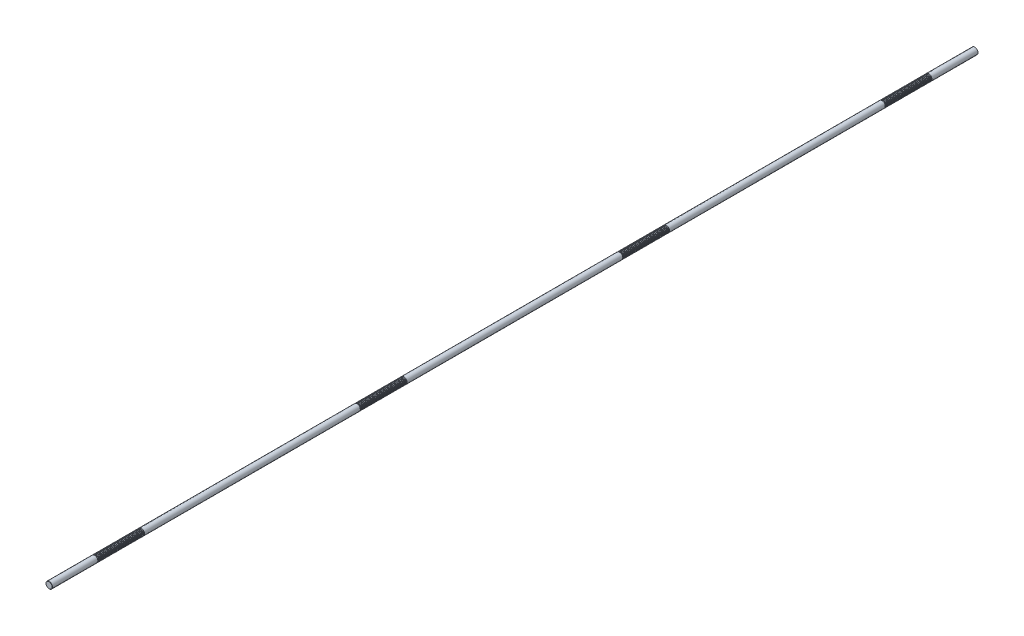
from build123d import *

# Parameters (mm, degrees)
SKETCH1_R           = 7
BOSS_EXTRUDE1_DEPTH = 1000
CHAMFER1_SIZE       = 0.35
LPATTERN1_COUNT     = 34
LPATTERN1_PITCH     = 3
LPATTERN2_COUNT     = 4
LPATTERN2_PITCH     = 567


with BuildPart() as part:
    # Sketch1 → Boss-Extrude1 (new, symmetric)
    with BuildSketch(Plane.XY):
        Circle(SKETCH1_R)
    extrude(amount=BOSS_EXTRUDE1_DEPTH, both=True)

    # Chamfer1
    chamfer1_edges = [part.edges().sort_by_distance(p)[0] for p in [
        (-7, 0, -1000),
        (-7, 0, 1000),
    ]]
    chamfer(chamfer1_edges, length=CHAMFER1_SIZE)

    # Sketch2 → Cut-Revolve1 (revolve, cut)
    with BuildSketch(Plane(origin=(0, 0, 0), x_dir=(0, 0, -1), z_dir=(1, 0, 0)), mode=Mode.PRIVATE) as cut_revolve1_sk:
        Polygon((900.234455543, 7), (898.265544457, 7), (898.734455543, 5.25), (899.765544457, 5.25), align=None)
    cut_revolve1 = revolve(cut_revolve1_sk.sketch.rotate(Axis((0, 0, 1000), (0, 0, -1)), 90), axis=Axis((0, 0, 1000), (0, 0, -1)), mode=Mode.SUBTRACT)

    # LPattern1: Cut-Revolve1 ×34
    with Locations(*[(0, 0, i * LPATTERN1_PITCH) for i in range(1, LPATTERN1_COUNT)]):
        add(cut_revolve1, mode=Mode.SUBTRACT)

    # LPattern2: Cut-Revolve1 ×4
    with Locations(*[(0, 0, i * LPATTERN2_PITCH) for i in range(1, LPATTERN2_COUNT)]):
        add(cut_revolve1, mode=Mode.SUBTRACT)

    # LPattern2 copy 1 sketch → LPattern2 copy 1 (revolve, cut)
    with BuildSketch(Plane(origin=(0, 0, 570), x_dir=(0, 0, -1), z_dir=(1, 0, 0))):
        Polygon((900.234455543, 7), (898.265544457, 7), (898.734455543, 5.25), (899.765544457, 5.25), align=None)
    revolve(axis=Axis((0, 0, 1570), (0, 0, -1)), mode=Mode.SUBTRACT)

    # LPattern2 copy 2 sketch → LPattern2 copy 2 (revolve, cut)
    with BuildSketch(Plane(origin=(0, 0, 1137), x_dir=(0, 0, -1), z_dir=(1, 0, 0))):
        Polygon((900.234455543, 7), (898.265544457, 7), (898.734455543, 5.25), (899.765544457, 5.25), align=None)
    revolve(axis=Axis((0, 0, 2137), (0, 0, -1)), mode=Mode.SUBTRACT)

    # LPattern2 copy 3 sketch → LPattern2 copy 3 (revolve, cut)
    with BuildSketch(Plane(origin=(0, 0, 1704), x_dir=(0, 0, -1), z_dir=(1, 0, 0))):
        Polygon((900.234455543, 7), (898.265544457, 7), (898.734455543, 5.25), (899.765544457, 5.25), align=None)
    revolve(axis=Axis((0, 0, 2704), (0, 0, -1)), mode=Mode.SUBTRACT)

    # LPattern2 copy 4 sketch → LPattern2 copy 4 (revolve, cut)
    with BuildSketch(Plane(origin=(0, 0, 573), x_dir=(0, 0, -1), z_dir=(1, 0, 0))):
        Polygon((900.234455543, 7), (898.265544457, 7), (898.734455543, 5.25), (899.765544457, 5.25), align=None)
    revolve(axis=Axis((0, 0, 1573), (0, 0, -1)), mode=Mode.SUBTRACT)

    # LPattern2 copy 5 sketch → LPattern2 copy 5 (revolve, cut)
    with BuildSketch(Plane(origin=(0, 0, 1140), x_dir=(0, 0, -1), z_dir=(1, 0, 0))):
        Polygon((900.234455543, 7), (898.265544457, 7), (898.734455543, 5.25), (899.765544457, 5.25), align=None)
    revolve(axis=Axis((0, 0, 2140), (0, 0, -1)), mode=Mode.SUBTRACT)

    # LPattern2 copy 6 sketch → LPattern2 copy 6 (revolve, cut)
    with BuildSketch(Plane(origin=(0, 0, 1707), x_dir=(0, 0, -1), z_dir=(1, 0, 0))):
        Polygon((900.234455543, 7), (898.265544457, 7), (898.734455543, 5.25), (899.765544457, 5.25), align=None)
    revolve(axis=Axis((0, 0, 2707), (0, 0, -1)), mode=Mode.SUBTRACT)

    # LPattern2 copy 7 sketch → LPattern2 copy 7 (revolve, cut)
    with BuildSketch(Plane(origin=(0, 0, 576), x_dir=(0, 0, -1), z_dir=(1, 0, 0))):
        Polygon((900.234455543, 7), (898.265544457, 7), (898.734455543, 5.25), (899.765544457, 5.25), align=None)
    revolve(axis=Axis((0, 0, 1576), (0, 0, -1)), mode=Mode.SUBTRACT)

    # LPattern2 copy 8 sketch → LPattern2 copy 8 (revolve, cut)
    with BuildSketch(Plane(origin=(0, 0, 1143), x_dir=(0, 0, -1), z_dir=(1, 0, 0))):
        Polygon((900.234455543, 7), (898.265544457, 7), (898.734455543, 5.25), (899.765544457, 5.25), align=None)
    revolve(axis=Axis((0, 0, 2143), (0, 0, -1)), mode=Mode.SUBTRACT)

    # LPattern2 copy 9 sketch → LPattern2 copy 9 (revolve, cut)
    with BuildSketch(Plane(origin=(0, 0, 1710), x_dir=(0, 0, -1), z_dir=(1, 0, 0))):
        Polygon((900.234455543, 7), (898.265544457, 7), (898.734455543, 5.25), (899.765544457, 5.25), align=None)
    revolve(axis=Axis((0, 0, 2710), (0, 0, -1)), mode=Mode.SUBTRACT)

    # LPattern2 copy 10 sketch → LPattern2 copy 10 (revolve, cut)
    with BuildSketch(Plane(origin=(0, 0, 579), x_dir=(0, 0, -1), z_dir=(1, 0, 0))):
        Polygon((900.234455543, 7), (898.265544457, 7), (898.734455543, 5.25), (899.765544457, 5.25), align=None)
    revolve(axis=Axis((0, 0, 1579), (0, 0, -1)), mode=Mode.SUBTRACT)

    # LPattern2 copy 11 sketch → LPattern2 copy 11 (revolve, cut)
    with BuildSketch(Plane(origin=(0, 0, 1146), x_dir=(0, 0, -1), z_dir=(1, 0, 0))):
        Polygon((900.234455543, 7), (898.265544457, 7), (898.734455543, 5.25), (899.765544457, 5.25), align=None)
    revolve(axis=Axis((0, 0, 2146), (0, 0, -1)), mode=Mode.SUBTRACT)

    # LPattern2 copy 12 sketch → LPattern2 copy 12 (revolve, cut)
    with BuildSketch(Plane(origin=(0, 0, 1713), x_dir=(0, 0, -1), z_dir=(1, 0, 0))):
        Polygon((900.234455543, 7), (898.265544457, 7), (898.734455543, 5.25), (899.765544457, 5.25), align=None)
    revolve(axis=Axis((0, 0, 2713), (0, 0, -1)), mode=Mode.SUBTRACT)

    # LPattern2 copy 13 sketch → LPattern2 copy 13 (revolve, cut)
    with BuildSketch(Plane(origin=(0, 0, 582), x_dir=(0, 0, -1), z_dir=(1, 0, 0))):
        Polygon((900.234455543, 7), (898.265544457, 7), (898.734455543, 5.25), (899.765544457, 5.25), align=None)
    revolve(axis=Axis((0, 0, 1582), (0, 0, -1)), mode=Mode.SUBTRACT)

    # LPattern2 copy 14 sketch → LPattern2 copy 14 (revolve, cut)
    with BuildSketch(Plane(origin=(0, 0, 1149), x_dir=(0, 0, -1), z_dir=(1, 0, 0))):
        Polygon((900.234455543, 7), (898.265544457, 7), (898.734455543, 5.25), (899.765544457, 5.25), align=None)
    revolve(axis=Axis((0, 0, 2149), (0, 0, -1)), mode=Mode.SUBTRACT)

    # LPattern2 copy 15 sketch → LPattern2 copy 15 (revolve, cut)
    with BuildSketch(Plane(origin=(0, 0, 1716), x_dir=(0, 0, -1), z_dir=(1, 0, 0))):
        Polygon((900.234455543, 7), (898.265544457, 7), (898.734455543, 5.25), (899.765544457, 5.25), align=None)
    revolve(axis=Axis((0, 0, 2716), (0, 0, -1)), mode=Mode.SUBTRACT)

    # LPattern2 copy 16 sketch → LPattern2 copy 16 (revolve, cut)
    with BuildSketch(Plane(origin=(0, 0, 585), x_dir=(0, 0, -1), z_dir=(1, 0, 0))):
        Polygon((900.234455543, 7), (898.265544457, 7), (898.734455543, 5.25), (899.765544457, 5.25), align=None)
    revolve(axis=Axis((0, 0, 1585), (0, 0, -1)), mode=Mode.SUBTRACT)

    # LPattern2 copy 17 sketch → LPattern2 copy 17 (revolve, cut)
    with BuildSketch(Plane(origin=(0, 0, 1152), x_dir=(0, 0, -1), z_dir=(1, 0, 0))):
        Polygon((900.234455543, 7), (898.265544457, 7), (898.734455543, 5.25), (899.765544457, 5.25), align=None)
    revolve(axis=Axis((0, 0, 2152), (0, 0, -1)), mode=Mode.SUBTRACT)

    # LPattern2 copy 18 sketch → LPattern2 copy 18 (revolve, cut)
    with BuildSketch(Plane(origin=(0, 0, 1719), x_dir=(0, 0, -1), z_dir=(1, 0, 0))):
        Polygon((900.234455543, 7), (898.265544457, 7), (898.734455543, 5.25), (899.765544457, 5.25), align=None)
    revolve(axis=Axis((0, 0, 2719), (0, 0, -1)), mode=Mode.SUBTRACT)

    # LPattern2 copy 19 sketch → LPattern2 copy 19 (revolve, cut)
    with BuildSketch(Plane(origin=(0, 0, 588), x_dir=(0, 0, -1), z_dir=(1, 0, 0))):
        Polygon((900.234455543, 7), (898.265544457, 7), (898.734455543, 5.25), (899.765544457, 5.25), align=None)
    revolve(axis=Axis((0, 0, 1588), (0, 0, -1)), mode=Mode.SUBTRACT)

    # LPattern2 copy 20 sketch → LPattern2 copy 20 (revolve, cut)
    with BuildSketch(Plane(origin=(0, 0, 1155), x_dir=(0, 0, -1), z_dir=(1, 0, 0))):
        Polygon((900.234455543, 7), (898.265544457, 7), (898.734455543, 5.25), (899.765544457, 5.25), align=None)
    revolve(axis=Axis((0, 0, 2155), (0, 0, -1)), mode=Mode.SUBTRACT)

    # LPattern2 copy 21 sketch → LPattern2 copy 21 (revolve, cut)
    with BuildSketch(Plane(origin=(0, 0, 1722), x_dir=(0, 0, -1), z_dir=(1, 0, 0))):
        Polygon((900.234455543, 7), (898.265544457, 7), (898.734455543, 5.25), (899.765544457, 5.25), align=None)
    revolve(axis=Axis((0, 0, 2722), (0, 0, -1)), mode=Mode.SUBTRACT)

    # LPattern2 copy 22 sketch → LPattern2 copy 22 (revolve, cut)
    with BuildSketch(Plane(origin=(0, 0, 591), x_dir=(0, 0, -1), z_dir=(1, 0, 0))):
        Polygon((900.234455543, 7), (898.265544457, 7), (898.734455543, 5.25), (899.765544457, 5.25), align=None)
    revolve(axis=Axis((0, 0, 1591), (0, 0, -1)), mode=Mode.SUBTRACT)

    # LPattern2 copy 23 sketch → LPattern2 copy 23 (revolve, cut)
    with BuildSketch(Plane(origin=(0, 0, 1158), x_dir=(0, 0, -1), z_dir=(1, 0, 0))):
        Polygon((900.234455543, 7), (898.265544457, 7), (898.734455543, 5.25), (899.765544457, 5.25), align=None)
    revolve(axis=Axis((0, 0, 2158), (0, 0, -1)), mode=Mode.SUBTRACT)

    # LPattern2 copy 24 sketch → LPattern2 copy 24 (revolve, cut)
    with BuildSketch(Plane(origin=(0, 0, 1725), x_dir=(0, 0, -1), z_dir=(1, 0, 0))):
        Polygon((900.234455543, 7), (898.265544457, 7), (898.734455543, 5.25), (899.765544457, 5.25), align=None)
    revolve(axis=Axis((0, 0, 2725), (0, 0, -1)), mode=Mode.SUBTRACT)

    # LPattern2 copy 25 sketch → LPattern2 copy 25 (revolve, cut)
    with BuildSketch(Plane(origin=(0, 0, 594), x_dir=(0, 0, -1), z_dir=(1, 0, 0))):
        Polygon((900.234455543, 7), (898.265544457, 7), (898.734455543, 5.25), (899.765544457, 5.25), align=None)
    revolve(axis=Axis((0, 0, 1594), (0, 0, -1)), mode=Mode.SUBTRACT)

    # LPattern2 copy 26 sketch → LPattern2 copy 26 (revolve, cut)
    with BuildSketch(Plane(origin=(0, 0, 1161), x_dir=(0, 0, -1), z_dir=(1, 0, 0))):
        Polygon((900.234455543, 7), (898.265544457, 7), (898.734455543, 5.25), (899.765544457, 5.25), align=None)
    revolve(axis=Axis((0, 0, 2161), (0, 0, -1)), mode=Mode.SUBTRACT)

    # LPattern2 copy 27 sketch → LPattern2 copy 27 (revolve, cut)
    with BuildSketch(Plane(origin=(0, 0, 1728), x_dir=(0, 0, -1), z_dir=(1, 0, 0))):
        Polygon((900.234455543, 7), (898.265544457, 7), (898.734455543, 5.25), (899.765544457, 5.25), align=None)
    revolve(axis=Axis((0, 0, 2728), (0, 0, -1)), mode=Mode.SUBTRACT)

    # LPattern2 copy 28 sketch → LPattern2 copy 28 (revolve, cut)
    with BuildSketch(Plane(origin=(0, 0, 597), x_dir=(0, 0, -1), z_dir=(1, 0, 0))):
        Polygon((900.234455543, 7), (898.265544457, 7), (898.734455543, 5.25), (899.765544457, 5.25), align=None)
    revolve(axis=Axis((0, 0, 1597), (0, 0, -1)), mode=Mode.SUBTRACT)

    # LPattern2 copy 29 sketch → LPattern2 copy 29 (revolve, cut)
    with BuildSketch(Plane(origin=(0, 0, 1164), x_dir=(0, 0, -1), z_dir=(1, 0, 0))):
        Polygon((900.234455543, 7), (898.265544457, 7), (898.734455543, 5.25), (899.765544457, 5.25), align=None)
    revolve(axis=Axis((0, 0, 2164), (0, 0, -1)), mode=Mode.SUBTRACT)

    # LPattern2 copy 30 sketch → LPattern2 copy 30 (revolve, cut)
    with BuildSketch(Plane(origin=(0, 0, 1731), x_dir=(0, 0, -1), z_dir=(1, 0, 0))):
        Polygon((900.234455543, 7), (898.265544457, 7), (898.734455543, 5.25), (899.765544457, 5.25), align=None)
    revolve(axis=Axis((0, 0, 2731), (0, 0, -1)), mode=Mode.SUBTRACT)

    # LPattern2 copy 31 sketch → LPattern2 copy 31 (revolve, cut)
    with BuildSketch(Plane(origin=(0, 0, 600), x_dir=(0, 0, -1), z_dir=(1, 0, 0))):
        Polygon((900.234455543, 7), (898.265544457, 7), (898.734455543, 5.25), (899.765544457, 5.25), align=None)
    revolve(axis=Axis((0, 0, 1600), (0, 0, -1)), mode=Mode.SUBTRACT)

    # LPattern2 copy 32 sketch → LPattern2 copy 32 (revolve, cut)
    with BuildSketch(Plane(origin=(0, 0, 1167), x_dir=(0, 0, -1), z_dir=(1, 0, 0))):
        Polygon((900.234455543, 7), (898.265544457, 7), (898.734455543, 5.25), (899.765544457, 5.25), align=None)
    revolve(axis=Axis((0, 0, 2167), (0, 0, -1)), mode=Mode.SUBTRACT)

    # LPattern2 copy 33 sketch → LPattern2 copy 33 (revolve, cut)
    with BuildSketch(Plane(origin=(0, 0, 1734), x_dir=(0, 0, -1), z_dir=(1, 0, 0))):
        Polygon((900.234455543, 7), (898.265544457, 7), (898.734455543, 5.25), (899.765544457, 5.25), align=None)
    revolve(axis=Axis((0, 0, 2734), (0, 0, -1)), mode=Mode.SUBTRACT)

    # LPattern2 copy 34 sketch → LPattern2 copy 34 (revolve, cut)
    with BuildSketch(Plane(origin=(0, 0, 603), x_dir=(0, 0, -1), z_dir=(1, 0, 0))):
        Polygon((900.234455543, 7), (898.265544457, 7), (898.734455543, 5.25), (899.765544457, 5.25), align=None)
    revolve(axis=Axis((0, 0, 1603), (0, 0, -1)), mode=Mode.SUBTRACT)

    # LPattern2 copy 35 sketch → LPattern2 copy 35 (revolve, cut)
    with BuildSketch(Plane(origin=(0, 0, 1170), x_dir=(0, 0, -1), z_dir=(1, 0, 0))):
        Polygon((900.234455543, 7), (898.265544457, 7), (898.734455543, 5.25), (899.765544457, 5.25), align=None)
    revolve(axis=Axis((0, 0, 2170), (0, 0, -1)), mode=Mode.SUBTRACT)

    # LPattern2 copy 36 sketch → LPattern2 copy 36 (revolve, cut)
    with BuildSketch(Plane(origin=(0, 0, 1737), x_dir=(0, 0, -1), z_dir=(1, 0, 0))):
        Polygon((900.234455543, 7), (898.265544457, 7), (898.734455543, 5.25), (899.765544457, 5.25), align=None)
    revolve(axis=Axis((0, 0, 2737), (0, 0, -1)), mode=Mode.SUBTRACT)

    # LPattern2 copy 37 sketch → LPattern2 copy 37 (revolve, cut)
    with BuildSketch(Plane(origin=(0, 0, 606), x_dir=(0, 0, -1), z_dir=(1, 0, 0))):
        Polygon((900.234455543, 7), (898.265544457, 7), (898.734455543, 5.25), (899.765544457, 5.25), align=None)
    revolve(axis=Axis((0, 0, 1606), (0, 0, -1)), mode=Mode.SUBTRACT)

    # LPattern2 copy 38 sketch → LPattern2 copy 38 (revolve, cut)
    with BuildSketch(Plane(origin=(0, 0, 1173), x_dir=(0, 0, -1), z_dir=(1, 0, 0))):
        Polygon((900.234455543, 7), (898.265544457, 7), (898.734455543, 5.25), (899.765544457, 5.25), align=None)
    revolve(axis=Axis((0, 0, 2173), (0, 0, -1)), mode=Mode.SUBTRACT)

    # LPattern2 copy 39 sketch → LPattern2 copy 39 (revolve, cut)
    with BuildSketch(Plane(origin=(0, 0, 1740), x_dir=(0, 0, -1), z_dir=(1, 0, 0))):
        Polygon((900.234455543, 7), (898.265544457, 7), (898.734455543, 5.25), (899.765544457, 5.25), align=None)
    revolve(axis=Axis((0, 0, 2740), (0, 0, -1)), mode=Mode.SUBTRACT)

    # LPattern2 copy 40 sketch → LPattern2 copy 40 (revolve, cut)
    with BuildSketch(Plane(origin=(0, 0, 609), x_dir=(0, 0, -1), z_dir=(1, 0, 0))):
        Polygon((900.234455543, 7), (898.265544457, 7), (898.734455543, 5.25), (899.765544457, 5.25), align=None)
    revolve(axis=Axis((0, 0, 1609), (0, 0, -1)), mode=Mode.SUBTRACT)

    # LPattern2 copy 41 sketch → LPattern2 copy 41 (revolve, cut)
    with BuildSketch(Plane(origin=(0, 0, 1176), x_dir=(0, 0, -1), z_dir=(1, 0, 0))):
        Polygon((900.234455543, 7), (898.265544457, 7), (898.734455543, 5.25), (899.765544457, 5.25), align=None)
    revolve(axis=Axis((0, 0, 2176), (0, 0, -1)), mode=Mode.SUBTRACT)

    # LPattern2 copy 42 sketch → LPattern2 copy 42 (revolve, cut)
    with BuildSketch(Plane(origin=(0, 0, 1743), x_dir=(0, 0, -1), z_dir=(1, 0, 0))):
        Polygon((900.234455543, 7), (898.265544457, 7), (898.734455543, 5.25), (899.765544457, 5.25), align=None)
    revolve(axis=Axis((0, 0, 2743), (0, 0, -1)), mode=Mode.SUBTRACT)

    # LPattern2 copy 43 sketch → LPattern2 copy 43 (revolve, cut)
    with BuildSketch(Plane(origin=(0, 0, 612), x_dir=(0, 0, -1), z_dir=(1, 0, 0))):
        Polygon((900.234455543, 7), (898.265544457, 7), (898.734455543, 5.25), (899.765544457, 5.25), align=None)
    revolve(axis=Axis((0, 0, 1612), (0, 0, -1)), mode=Mode.SUBTRACT)

    # LPattern2 copy 44 sketch → LPattern2 copy 44 (revolve, cut)
    with BuildSketch(Plane(origin=(0, 0, 1179), x_dir=(0, 0, -1), z_dir=(1, 0, 0))):
        Polygon((900.234455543, 7), (898.265544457, 7), (898.734455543, 5.25), (899.765544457, 5.25), align=None)
    revolve(axis=Axis((0, 0, 2179), (0, 0, -1)), mode=Mode.SUBTRACT)

    # LPattern2 copy 45 sketch → LPattern2 copy 45 (revolve, cut)
    with BuildSketch(Plane(origin=(0, 0, 1746), x_dir=(0, 0, -1), z_dir=(1, 0, 0))):
        Polygon((900.234455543, 7), (898.265544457, 7), (898.734455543, 5.25), (899.765544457, 5.25), align=None)
    revolve(axis=Axis((0, 0, 2746), (0, 0, -1)), mode=Mode.SUBTRACT)

    # LPattern2 copy 46 sketch → LPattern2 copy 46 (revolve, cut)
    with BuildSketch(Plane(origin=(0, 0, 615), x_dir=(0, 0, -1), z_dir=(1, 0, 0))):
        Polygon((900.234455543, 7), (898.265544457, 7), (898.734455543, 5.25), (899.765544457, 5.25), align=None)
    revolve(axis=Axis((0, 0, 1615), (0, 0, -1)), mode=Mode.SUBTRACT)

    # LPattern2 copy 47 sketch → LPattern2 copy 47 (revolve, cut)
    with BuildSketch(Plane(origin=(0, 0, 1182), x_dir=(0, 0, -1), z_dir=(1, 0, 0))):
        Polygon((900.234455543, 7), (898.265544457, 7), (898.734455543, 5.25), (899.765544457, 5.25), align=None)
    revolve(axis=Axis((0, 0, 2182), (0, 0, -1)), mode=Mode.SUBTRACT)

    # LPattern2 copy 48 sketch → LPattern2 copy 48 (revolve, cut)
    with BuildSketch(Plane(origin=(0, 0, 1749), x_dir=(0, 0, -1), z_dir=(1, 0, 0))):
        Polygon((900.234455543, 7), (898.265544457, 7), (898.734455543, 5.25), (899.765544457, 5.25), align=None)
    revolve(axis=Axis((0, 0, 2749), (0, 0, -1)), mode=Mode.SUBTRACT)

    # LPattern2 copy 49 sketch → LPattern2 copy 49 (revolve, cut)
    with BuildSketch(Plane(origin=(0, 0, 618), x_dir=(0, 0, -1), z_dir=(1, 0, 0))):
        Polygon((900.234455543, 7), (898.265544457, 7), (898.734455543, 5.25), (899.765544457, 5.25), align=None)
    revolve(axis=Axis((0, 0, 1618), (0, 0, -1)), mode=Mode.SUBTRACT)

    # LPattern2 copy 50 sketch → LPattern2 copy 50 (revolve, cut)
    with BuildSketch(Plane(origin=(0, 0, 1185), x_dir=(0, 0, -1), z_dir=(1, 0, 0))):
        Polygon((900.234455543, 7), (898.265544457, 7), (898.734455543, 5.25), (899.765544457, 5.25), align=None)
    revolve(axis=Axis((0, 0, 2185), (0, 0, -1)), mode=Mode.SUBTRACT)

    # LPattern2 copy 51 sketch → LPattern2 copy 51 (revolve, cut)
    with BuildSketch(Plane(origin=(0, 0, 1752), x_dir=(0, 0, -1), z_dir=(1, 0, 0))):
        Polygon((900.234455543, 7), (898.265544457, 7), (898.734455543, 5.25), (899.765544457, 5.25), align=None)
    revolve(axis=Axis((0, 0, 2752), (0, 0, -1)), mode=Mode.SUBTRACT)

    # LPattern2 copy 52 sketch → LPattern2 copy 52 (revolve, cut)
    with BuildSketch(Plane(origin=(0, 0, 621), x_dir=(0, 0, -1), z_dir=(1, 0, 0))):
        Polygon((900.234455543, 7), (898.265544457, 7), (898.734455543, 5.25), (899.765544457, 5.25), align=None)
    revolve(axis=Axis((0, 0, 1621), (0, 0, -1)), mode=Mode.SUBTRACT)

    # LPattern2 copy 53 sketch → LPattern2 copy 53 (revolve, cut)
    with BuildSketch(Plane(origin=(0, 0, 1188), x_dir=(0, 0, -1), z_dir=(1, 0, 0))):
        Polygon((900.234455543, 7), (898.265544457, 7), (898.734455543, 5.25), (899.765544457, 5.25), align=None)
    revolve(axis=Axis((0, 0, 2188), (0, 0, -1)), mode=Mode.SUBTRACT)

    # LPattern2 copy 54 sketch → LPattern2 copy 54 (revolve, cut)
    with BuildSketch(Plane(origin=(0, 0, 1755), x_dir=(0, 0, -1), z_dir=(1, 0, 0))):
        Polygon((900.234455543, 7), (898.265544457, 7), (898.734455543, 5.25), (899.765544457, 5.25), align=None)
    revolve(axis=Axis((0, 0, 2755), (0, 0, -1)), mode=Mode.SUBTRACT)

    # LPattern2 copy 55 sketch → LPattern2 copy 55 (revolve, cut)
    with BuildSketch(Plane(origin=(0, 0, 624), x_dir=(0, 0, -1), z_dir=(1, 0, 0))):
        Polygon((900.234455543, 7), (898.265544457, 7), (898.734455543, 5.25), (899.765544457, 5.25), align=None)
    revolve(axis=Axis((0, 0, 1624), (0, 0, -1)), mode=Mode.SUBTRACT)

    # LPattern2 copy 56 sketch → LPattern2 copy 56 (revolve, cut)
    with BuildSketch(Plane(origin=(0, 0, 1191), x_dir=(0, 0, -1), z_dir=(1, 0, 0))):
        Polygon((900.234455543, 7), (898.265544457, 7), (898.734455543, 5.25), (899.765544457, 5.25), align=None)
    revolve(axis=Axis((0, 0, 2191), (0, 0, -1)), mode=Mode.SUBTRACT)

    # LPattern2 copy 57 sketch → LPattern2 copy 57 (revolve, cut)
    with BuildSketch(Plane(origin=(0, 0, 1758), x_dir=(0, 0, -1), z_dir=(1, 0, 0))):
        Polygon((900.234455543, 7), (898.265544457, 7), (898.734455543, 5.25), (899.765544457, 5.25), align=None)
    revolve(axis=Axis((0, 0, 2758), (0, 0, -1)), mode=Mode.SUBTRACT)

    # LPattern2 copy 58 sketch → LPattern2 copy 58 (revolve, cut)
    with BuildSketch(Plane(origin=(0, 0, 627), x_dir=(0, 0, -1), z_dir=(1, 0, 0))):
        Polygon((900.234455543, 7), (898.265544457, 7), (898.734455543, 5.25), (899.765544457, 5.25), align=None)
    revolve(axis=Axis((0, 0, 1627), (0, 0, -1)), mode=Mode.SUBTRACT)

    # LPattern2 copy 59 sketch → LPattern2 copy 59 (revolve, cut)
    with BuildSketch(Plane(origin=(0, 0, 1194), x_dir=(0, 0, -1), z_dir=(1, 0, 0))):
        Polygon((900.234455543, 7), (898.265544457, 7), (898.734455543, 5.25), (899.765544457, 5.25), align=None)
    revolve(axis=Axis((0, 0, 2194), (0, 0, -1)), mode=Mode.SUBTRACT)

    # LPattern2 copy 60 sketch → LPattern2 copy 60 (revolve, cut)
    with BuildSketch(Plane(origin=(0, 0, 1761), x_dir=(0, 0, -1), z_dir=(1, 0, 0))):
        Polygon((900.234455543, 7), (898.265544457, 7), (898.734455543, 5.25), (899.765544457, 5.25), align=None)
    revolve(axis=Axis((0, 0, 2761), (0, 0, -1)), mode=Mode.SUBTRACT)

    # LPattern2 copy 61 sketch → LPattern2 copy 61 (revolve, cut)
    with BuildSketch(Plane(origin=(0, 0, 630), x_dir=(0, 0, -1), z_dir=(1, 0, 0))):
        Polygon((900.234455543, 7), (898.265544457, 7), (898.734455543, 5.25), (899.765544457, 5.25), align=None)
    revolve(axis=Axis((0, 0, 1630), (0, 0, -1)), mode=Mode.SUBTRACT)

    # LPattern2 copy 62 sketch → LPattern2 copy 62 (revolve, cut)
    with BuildSketch(Plane(origin=(0, 0, 1197), x_dir=(0, 0, -1), z_dir=(1, 0, 0))):
        Polygon((900.234455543, 7), (898.265544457, 7), (898.734455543, 5.25), (899.765544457, 5.25), align=None)
    revolve(axis=Axis((0, 0, 2197), (0, 0, -1)), mode=Mode.SUBTRACT)

    # LPattern2 copy 63 sketch → LPattern2 copy 63 (revolve, cut)
    with BuildSketch(Plane(origin=(0, 0, 1764), x_dir=(0, 0, -1), z_dir=(1, 0, 0))):
        Polygon((900.234455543, 7), (898.265544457, 7), (898.734455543, 5.25), (899.765544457, 5.25), align=None)
    revolve(axis=Axis((0, 0, 2764), (0, 0, -1)), mode=Mode.SUBTRACT)

    # LPattern2 copy 64 sketch → LPattern2 copy 64 (revolve, cut)
    with BuildSketch(Plane(origin=(0, 0, 633), x_dir=(0, 0, -1), z_dir=(1, 0, 0))):
        Polygon((900.234455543, 7), (898.265544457, 7), (898.734455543, 5.25), (899.765544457, 5.25), align=None)
    revolve(axis=Axis((0, 0, 1633), (0, 0, -1)), mode=Mode.SUBTRACT)

    # LPattern2 copy 65 sketch → LPattern2 copy 65 (revolve, cut)
    with BuildSketch(Plane(origin=(0, 0, 1200), x_dir=(0, 0, -1), z_dir=(1, 0, 0))):
        Polygon((900.234455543, 7), (898.265544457, 7), (898.734455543, 5.25), (899.765544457, 5.25), align=None)
    revolve(axis=Axis((0, 0, 2200), (0, 0, -1)), mode=Mode.SUBTRACT)

    # LPattern2 copy 66 sketch → LPattern2 copy 66 (revolve, cut)
    with BuildSketch(Plane(origin=(0, 0, 1767), x_dir=(0, 0, -1), z_dir=(1, 0, 0))):
        Polygon((900.234455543, 7), (898.265544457, 7), (898.734455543, 5.25), (899.765544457, 5.25), align=None)
    revolve(axis=Axis((0, 0, 2767), (0, 0, -1)), mode=Mode.SUBTRACT)

    # LPattern2 copy 67 sketch → LPattern2 copy 67 (revolve, cut)
    with BuildSketch(Plane(origin=(0, 0, 636), x_dir=(0, 0, -1), z_dir=(1, 0, 0))):
        Polygon((900.234455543, 7), (898.265544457, 7), (898.734455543, 5.25), (899.765544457, 5.25), align=None)
    revolve(axis=Axis((0, 0, 1636), (0, 0, -1)), mode=Mode.SUBTRACT)

    # LPattern2 copy 68 sketch → LPattern2 copy 68 (revolve, cut)
    with BuildSketch(Plane(origin=(0, 0, 1203), x_dir=(0, 0, -1), z_dir=(1, 0, 0))):
        Polygon((900.234455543, 7), (898.265544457, 7), (898.734455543, 5.25), (899.765544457, 5.25), align=None)
    revolve(axis=Axis((0, 0, 2203), (0, 0, -1)), mode=Mode.SUBTRACT)

    # LPattern2 copy 69 sketch → LPattern2 copy 69 (revolve, cut)
    with BuildSketch(Plane(origin=(0, 0, 1770), x_dir=(0, 0, -1), z_dir=(1, 0, 0))):
        Polygon((900.234455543, 7), (898.265544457, 7), (898.734455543, 5.25), (899.765544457, 5.25), align=None)
    revolve(axis=Axis((0, 0, 2770), (0, 0, -1)), mode=Mode.SUBTRACT)

    # LPattern2 copy 70 sketch → LPattern2 copy 70 (revolve, cut)
    with BuildSketch(Plane(origin=(0, 0, 639), x_dir=(0, 0, -1), z_dir=(1, 0, 0))):
        Polygon((900.234455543, 7), (898.265544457, 7), (898.734455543, 5.25), (899.765544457, 5.25), align=None)
    revolve(axis=Axis((0, 0, 1639), (0, 0, -1)), mode=Mode.SUBTRACT)

    # LPattern2 copy 71 sketch → LPattern2 copy 71 (revolve, cut)
    with BuildSketch(Plane(origin=(0, 0, 1206), x_dir=(0, 0, -1), z_dir=(1, 0, 0))):
        Polygon((900.234455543, 7), (898.265544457, 7), (898.734455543, 5.25), (899.765544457, 5.25), align=None)
    revolve(axis=Axis((0, 0, 2206), (0, 0, -1)), mode=Mode.SUBTRACT)

    # LPattern2 copy 72 sketch → LPattern2 copy 72 (revolve, cut)
    with BuildSketch(Plane(origin=(0, 0, 1773), x_dir=(0, 0, -1), z_dir=(1, 0, 0))):
        Polygon((900.234455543, 7), (898.265544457, 7), (898.734455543, 5.25), (899.765544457, 5.25), align=None)
    revolve(axis=Axis((0, 0, 2773), (0, 0, -1)), mode=Mode.SUBTRACT)

    # LPattern2 copy 73 sketch → LPattern2 copy 73 (revolve, cut)
    with BuildSketch(Plane(origin=(0, 0, 642), x_dir=(0, 0, -1), z_dir=(1, 0, 0))):
        Polygon((900.234455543, 7), (898.265544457, 7), (898.734455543, 5.25), (899.765544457, 5.25), align=None)
    revolve(axis=Axis((0, 0, 1642), (0, 0, -1)), mode=Mode.SUBTRACT)

    # LPattern2 copy 74 sketch → LPattern2 copy 74 (revolve, cut)
    with BuildSketch(Plane(origin=(0, 0, 1209), x_dir=(0, 0, -1), z_dir=(1, 0, 0))):
        Polygon((900.234455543, 7), (898.265544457, 7), (898.734455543, 5.25), (899.765544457, 5.25), align=None)
    revolve(axis=Axis((0, 0, 2209), (0, 0, -1)), mode=Mode.SUBTRACT)

    # LPattern2 copy 75 sketch → LPattern2 copy 75 (revolve, cut)
    with BuildSketch(Plane(origin=(0, 0, 1776), x_dir=(0, 0, -1), z_dir=(1, 0, 0))):
        Polygon((900.234455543, 7), (898.265544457, 7), (898.734455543, 5.25), (899.765544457, 5.25), align=None)
    revolve(axis=Axis((0, 0, 2776), (0, 0, -1)), mode=Mode.SUBTRACT)

    # LPattern2 copy 76 sketch → LPattern2 copy 76 (revolve, cut)
    with BuildSketch(Plane(origin=(0, 0, 645), x_dir=(0, 0, -1), z_dir=(1, 0, 0))):
        Polygon((900.234455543, 7), (898.265544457, 7), (898.734455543, 5.25), (899.765544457, 5.25), align=None)
    revolve(axis=Axis((0, 0, 1645), (0, 0, -1)), mode=Mode.SUBTRACT)

    # LPattern2 copy 77 sketch → LPattern2 copy 77 (revolve, cut)
    with BuildSketch(Plane(origin=(0, 0, 1212), x_dir=(0, 0, -1), z_dir=(1, 0, 0))):
        Polygon((900.234455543, 7), (898.265544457, 7), (898.734455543, 5.25), (899.765544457, 5.25), align=None)
    revolve(axis=Axis((0, 0, 2212), (0, 0, -1)), mode=Mode.SUBTRACT)

    # LPattern2 copy 78 sketch → LPattern2 copy 78 (revolve, cut)
    with BuildSketch(Plane(origin=(0, 0, 1779), x_dir=(0, 0, -1), z_dir=(1, 0, 0))):
        Polygon((900.234455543, 7), (898.265544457, 7), (898.734455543, 5.25), (899.765544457, 5.25), align=None)
    revolve(axis=Axis((0, 0, 2779), (0, 0, -1)), mode=Mode.SUBTRACT)

    # LPattern2 copy 79 sketch → LPattern2 copy 79 (revolve, cut)
    with BuildSketch(Plane(origin=(0, 0, 648), x_dir=(0, 0, -1), z_dir=(1, 0, 0))):
        Polygon((900.234455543, 7), (898.265544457, 7), (898.734455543, 5.25), (899.765544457, 5.25), align=None)
    revolve(axis=Axis((0, 0, 1648), (0, 0, -1)), mode=Mode.SUBTRACT)

    # LPattern2 copy 80 sketch → LPattern2 copy 80 (revolve, cut)
    with BuildSketch(Plane(origin=(0, 0, 1215), x_dir=(0, 0, -1), z_dir=(1, 0, 0))):
        Polygon((900.234455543, 7), (898.265544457, 7), (898.734455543, 5.25), (899.765544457, 5.25), align=None)
    revolve(axis=Axis((0, 0, 2215), (0, 0, -1)), mode=Mode.SUBTRACT)

    # LPattern2 copy 81 sketch → LPattern2 copy 81 (revolve, cut)
    with BuildSketch(Plane(origin=(0, 0, 1782), x_dir=(0, 0, -1), z_dir=(1, 0, 0))):
        Polygon((900.234455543, 7), (898.265544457, 7), (898.734455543, 5.25), (899.765544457, 5.25), align=None)
    revolve(axis=Axis((0, 0, 2782), (0, 0, -1)), mode=Mode.SUBTRACT)

    # LPattern2 copy 82 sketch → LPattern2 copy 82 (revolve, cut)
    with BuildSketch(Plane(origin=(0, 0, 651), x_dir=(0, 0, -1), z_dir=(1, 0, 0))):
        Polygon((900.234455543, 7), (898.265544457, 7), (898.734455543, 5.25), (899.765544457, 5.25), align=None)
    revolve(axis=Axis((0, 0, 1651), (0, 0, -1)), mode=Mode.SUBTRACT)

    # LPattern2 copy 83 sketch → LPattern2 copy 83 (revolve, cut)
    with BuildSketch(Plane(origin=(0, 0, 1218), x_dir=(0, 0, -1), z_dir=(1, 0, 0))):
        Polygon((900.234455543, 7), (898.265544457, 7), (898.734455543, 5.25), (899.765544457, 5.25), align=None)
    revolve(axis=Axis((0, 0, 2218), (0, 0, -1)), mode=Mode.SUBTRACT)

    # LPattern2 copy 84 sketch → LPattern2 copy 84 (revolve, cut)
    with BuildSketch(Plane(origin=(0, 0, 1785), x_dir=(0, 0, -1), z_dir=(1, 0, 0))):
        Polygon((900.234455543, 7), (898.265544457, 7), (898.734455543, 5.25), (899.765544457, 5.25), align=None)
    revolve(axis=Axis((0, 0, 2785), (0, 0, -1)), mode=Mode.SUBTRACT)

    # LPattern2 copy 85 sketch → LPattern2 copy 85 (revolve, cut)
    with BuildSketch(Plane(origin=(0, 0, 654), x_dir=(0, 0, -1), z_dir=(1, 0, 0))):
        Polygon((900.234455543, 7), (898.265544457, 7), (898.734455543, 5.25), (899.765544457, 5.25), align=None)
    revolve(axis=Axis((0, 0, 1654), (0, 0, -1)), mode=Mode.SUBTRACT)

    # LPattern2 copy 86 sketch → LPattern2 copy 86 (revolve, cut)
    with BuildSketch(Plane(origin=(0, 0, 1221), x_dir=(0, 0, -1), z_dir=(1, 0, 0))):
        Polygon((900.234455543, 7), (898.265544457, 7), (898.734455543, 5.25), (899.765544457, 5.25), align=None)
    revolve(axis=Axis((0, 0, 2221), (0, 0, -1)), mode=Mode.SUBTRACT)

    # LPattern2 copy 87 sketch → LPattern2 copy 87 (revolve, cut)
    with BuildSketch(Plane(origin=(0, 0, 1788), x_dir=(0, 0, -1), z_dir=(1, 0, 0))):
        Polygon((900.234455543, 7), (898.265544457, 7), (898.734455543, 5.25), (899.765544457, 5.25), align=None)
    revolve(axis=Axis((0, 0, 2788), (0, 0, -1)), mode=Mode.SUBTRACT)

    # LPattern2 copy 88 sketch → LPattern2 copy 88 (revolve, cut)
    with BuildSketch(Plane(origin=(0, 0, 657), x_dir=(0, 0, -1), z_dir=(1, 0, 0))):
        Polygon((900.234455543, 7), (898.265544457, 7), (898.734455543, 5.25), (899.765544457, 5.25), align=None)
    revolve(axis=Axis((0, 0, 1657), (0, 0, -1)), mode=Mode.SUBTRACT)

    # LPattern2 copy 89 sketch → LPattern2 copy 89 (revolve, cut)
    with BuildSketch(Plane(origin=(0, 0, 1224), x_dir=(0, 0, -1), z_dir=(1, 0, 0))):
        Polygon((900.234455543, 7), (898.265544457, 7), (898.734455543, 5.25), (899.765544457, 5.25), align=None)
    revolve(axis=Axis((0, 0, 2224), (0, 0, -1)), mode=Mode.SUBTRACT)

    # LPattern2 copy 90 sketch → LPattern2 copy 90 (revolve, cut)
    with BuildSketch(Plane(origin=(0, 0, 1791), x_dir=(0, 0, -1), z_dir=(1, 0, 0))):
        Polygon((900.234455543, 7), (898.265544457, 7), (898.734455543, 5.25), (899.765544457, 5.25), align=None)
    revolve(axis=Axis((0, 0, 2791), (0, 0, -1)), mode=Mode.SUBTRACT)

    # LPattern2 copy 91 sketch → LPattern2 copy 91 (revolve, cut)
    with BuildSketch(Plane(origin=(0, 0, 660), x_dir=(0, 0, -1), z_dir=(1, 0, 0))):
        Polygon((900.234455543, 7), (898.265544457, 7), (898.734455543, 5.25), (899.765544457, 5.25), align=None)
    revolve(axis=Axis((0, 0, 1660), (0, 0, -1)), mode=Mode.SUBTRACT)

    # LPattern2 copy 92 sketch → LPattern2 copy 92 (revolve, cut)
    with BuildSketch(Plane(origin=(0, 0, 1227), x_dir=(0, 0, -1), z_dir=(1, 0, 0))):
        Polygon((900.234455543, 7), (898.265544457, 7), (898.734455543, 5.25), (899.765544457, 5.25), align=None)
    revolve(axis=Axis((0, 0, 2227), (0, 0, -1)), mode=Mode.SUBTRACT)

    # LPattern2 copy 93 sketch → LPattern2 copy 93 (revolve, cut)
    with BuildSketch(Plane(origin=(0, 0, 1794), x_dir=(0, 0, -1), z_dir=(1, 0, 0))):
        Polygon((900.234455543, 7), (898.265544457, 7), (898.734455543, 5.25), (899.765544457, 5.25), align=None)
    revolve(axis=Axis((0, 0, 2794), (0, 0, -1)), mode=Mode.SUBTRACT)

    # LPattern2 copy 94 sketch → LPattern2 copy 94 (revolve, cut)
    with BuildSketch(Plane(origin=(0, 0, 663), x_dir=(0, 0, -1), z_dir=(1, 0, 0))):
        Polygon((900.234455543, 7), (898.265544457, 7), (898.734455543, 5.25), (899.765544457, 5.25), align=None)
    revolve(axis=Axis((0, 0, 1663), (0, 0, -1)), mode=Mode.SUBTRACT)

    # LPattern2 copy 95 sketch → LPattern2 copy 95 (revolve, cut)
    with BuildSketch(Plane(origin=(0, 0, 1230), x_dir=(0, 0, -1), z_dir=(1, 0, 0))):
        Polygon((900.234455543, 7), (898.265544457, 7), (898.734455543, 5.25), (899.765544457, 5.25), align=None)
    revolve(axis=Axis((0, 0, 2230), (0, 0, -1)), mode=Mode.SUBTRACT)

    # LPattern2 copy 96 sketch → LPattern2 copy 96 (revolve, cut)
    with BuildSketch(Plane(origin=(0, 0, 1797), x_dir=(0, 0, -1), z_dir=(1, 0, 0))):
        Polygon((900.234455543, 7), (898.265544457, 7), (898.734455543, 5.25), (899.765544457, 5.25), align=None)
    revolve(axis=Axis((0, 0, 2797), (0, 0, -1)), mode=Mode.SUBTRACT)

    # LPattern2 copy 97 sketch → LPattern2 copy 97 (revolve, cut)
    with BuildSketch(Plane(origin=(0, 0, 666), x_dir=(0, 0, -1), z_dir=(1, 0, 0))):
        Polygon((900.234455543, 7), (898.265544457, 7), (898.734455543, 5.25), (899.765544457, 5.25), align=None)
    revolve(axis=Axis((0, 0, 1666), (0, 0, -1)), mode=Mode.SUBTRACT)

    # LPattern2 copy 98 sketch → LPattern2 copy 98 (revolve, cut)
    with BuildSketch(Plane(origin=(0, 0, 1233), x_dir=(0, 0, -1), z_dir=(1, 0, 0))):
        Polygon((900.234455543, 7), (898.265544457, 7), (898.734455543, 5.25), (899.765544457, 5.25), align=None)
    revolve(axis=Axis((0, 0, 2233), (0, 0, -1)), mode=Mode.SUBTRACT)

    # LPattern2 copy 99 sketch → LPattern2 copy 99 (revolve, cut)
    with BuildSketch(Plane(origin=(0, 0, 1800), x_dir=(0, 0, -1), z_dir=(1, 0, 0))):
        Polygon((900.234455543, 7), (898.265544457, 7), (898.734455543, 5.25), (899.765544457, 5.25), align=None)
    revolve(axis=Axis((0, 0, 2800), (0, 0, -1)), mode=Mode.SUBTRACT)


solid = part.part
